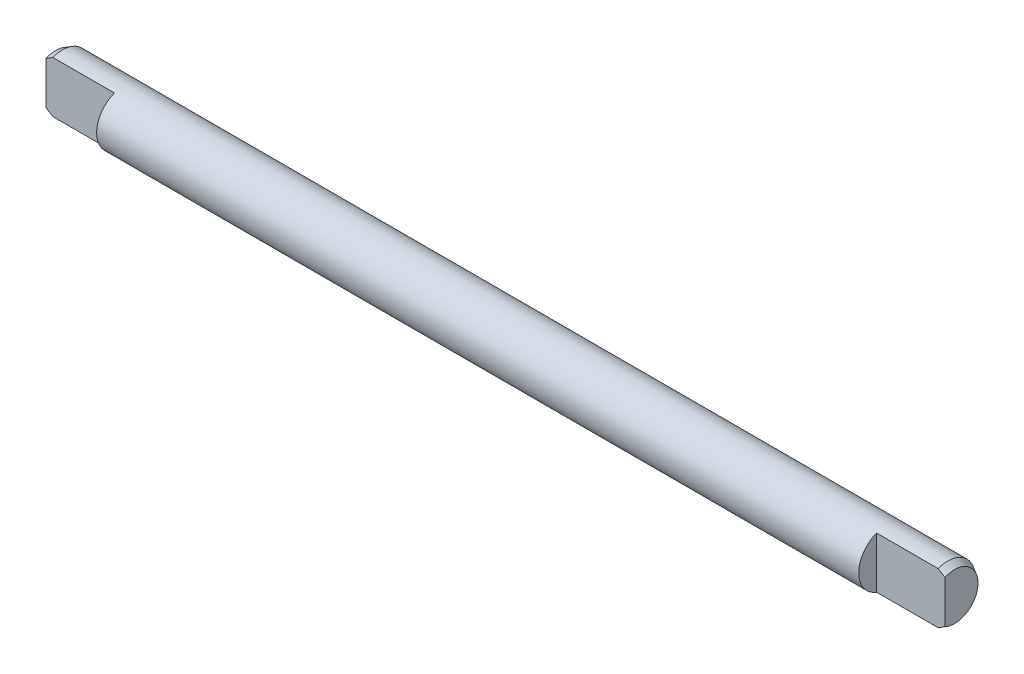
ISO-10303-21;
HEADER;
FILE_DESCRIPTION(('STEP AP214'),'2;1');
FILE_NAME('part.step','',(''),(''),'','','');
FILE_SCHEMA(('AUTOMOTIVE_DESIGN { 1 0 10303 214 1 1 1 1 }'));
ENDSEC;
DATA;
#1=APPLICATION_CONTEXT('core data for automotive mechanical design processes');
#2=APPLICATION_PROTOCOL_DEFINITION('international standard','automotive_design',2000,#1);
#3=PRODUCT_CONTEXT('',#1,'mechanical');
#4=PRODUCT('Part','Part','',(#3));
#5=PRODUCT_RELATED_PRODUCT_CATEGORY('part','',(#4));
#6=PRODUCT_DEFINITION_FORMATION('','',#4);
#7=PRODUCT_DEFINITION_CONTEXT('part definition',#1,'design');
#8=PRODUCT_DEFINITION('design','',#6,#7);
#9=PRODUCT_DEFINITION_SHAPE('','',#8);
#10=(LENGTH_UNIT() NAMED_UNIT(*) SI_UNIT(.MILLI.,.METRE.));
#11=(NAMED_UNIT(*) PLANE_ANGLE_UNIT() SI_UNIT($,.RADIAN.));
#12=(NAMED_UNIT(*) SI_UNIT($,.STERADIAN.) SOLID_ANGLE_UNIT());
#13=UNCERTAINTY_MEASURE_WITH_UNIT(LENGTH_MEASURE(1.E-05),#10,'distance_accuracy_value','');
#14=(GEOMETRIC_REPRESENTATION_CONTEXT(3) GLOBAL_UNCERTAINTY_ASSIGNED_CONTEXT((#13)) GLOBAL_UNIT_ASSIGNED_CONTEXT((#10,
#11,#12)) REPRESENTATION_CONTEXT('',''));
#15=CARTESIAN_POINT('',(0.,0.,0.));
#16=DIRECTION('',(0.,0.,1.));
#17=DIRECTION('',(1.,0.,0.));
#18=AXIS2_PLACEMENT_3D('',#15,#16,#17);
#19=CARTESIAN_POINT('',(10.15,-1.731860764,0.7));
#20=DIRECTION('',(1.,0.,0.));
#21=DIRECTION('',(0.,0.,-1.));
#22=AXIS2_PLACEMENT_3D('',#19,#20,#21);
#23=PLANE('',#22);
#24=DIRECTION('',(0.,-1.,0.));
#25=VECTOR('',#24,1.);
#26=CARTESIAN_POINT('',(10.15,0.,0.7));
#27=LINE('',#26,#25);
#28=CARTESIAN_POINT('',(10.1500000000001,1.56161224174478,0.7));
#29=VERTEX_POINT('',#28);
#30=CARTESIAN_POINT('',(10.1499999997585,-1.56161224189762,0.7));
#31=VERTEX_POINT('',#30);
#32=EDGE_CURVE('E61',#29,#31,#27,.T.);
#33=ORIENTED_EDGE('',*,*,#32,.T.);
#34=CARTESIAN_POINT('',(10.1500000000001,0.,0.));
#35=DIRECTION('',(-1.,0.,0.));
#36=DIRECTION('',(0.,0.,1.));
#37=AXIS2_PLACEMENT_3D('',#34,#35,#36);
#38=CIRCLE('',#37,1.71132486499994);
#39=EDGE_CURVE('E20',#31,#29,#38,.F.);
#40=ORIENTED_EDGE('',*,*,#39,.T.);
#41=EDGE_LOOP('',(#33,#40));
#42=FACE_BOUND('',#41,.T.);
#43=ADVANCED_FACE('F16',(#42),#23,.T.);
#44=CARTESIAN_POINT('',(5.15,-1.895981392,0.7));
#45=DIRECTION('',(-1.,0.,0.));
#46=DIRECTION('',(0.,0.,1.));
#47=AXIS2_PLACEMENT_3D('',#44,#45,#46);
#48=PLANE('',#47);
#49=CARTESIAN_POINT('',(5.1500000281,-1.0443035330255E-13,0.));
#50=DIRECTION('',(1.,0.,0.));
#51=DIRECTION('',(0.,1.,0.));
#52=AXIS2_PLACEMENT_3D('',#49,#50,#51);
#53=CIRCLE('',#52,2.);
#54=CARTESIAN_POINT('',(5.15000001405,1.87349939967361,0.699999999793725));
#55=VERTEX_POINT('',#54);
#56=CARTESIAN_POINT('',(5.15000001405,-1.87349939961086,0.699999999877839));
#57=VERTEX_POINT('',#56);
#58=EDGE_CURVE('E134',#55,#57,#53,.T.);
#59=ORIENTED_EDGE('',*,*,#58,.T.);
#60=DIRECTION('',(0.,1.,0.));
#61=VECTOR('',#60,1.);
#62=CARTESIAN_POINT('',(5.15,0.,0.7));
#63=LINE('',#62,#61);
#64=EDGE_CURVE('E74',#57,#55,#63,.T.);
#65=ORIENTED_EDGE('',*,*,#64,.T.);
#66=EDGE_LOOP('',(#59,#65));
#67=FACE_BOUND('',#66,.T.);
#68=ADVANCED_FACE('F104',(#67),#48,.F.);
#69=CARTESIAN_POINT('',(10.15,-1.8734994,0.7));
#70=DIRECTION('',(0.,0.,-1.));
#71=DIRECTION('',(-1.,0.,0.));
#72=AXIS2_PLACEMENT_3D('',#69,#70,#71);
#73=PLANE('',#72);
#74=CARTESIAN_POINT('',(9.64999999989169,-1.87349939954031,0.699999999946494));
#75=CARTESIAN_POINT('',(9.69180588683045,-1.84773253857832,0.699999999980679));
#76=CARTESIAN_POINT('',(9.73358315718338,-1.82191917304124,0.699999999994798));
#77=CARTESIAN_POINT('',(9.81707123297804,-1.7701859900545,0.700000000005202));
#78=CARTESIAN_POINT('',(9.85878203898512,-1.74426617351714,0.700000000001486));
#79=CARTESIAN_POINT('',(9.94212874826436,-1.69230615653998,0.699999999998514));
#80=CARTESIAN_POINT('',(9.98376465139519,-1.66626595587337,0.699999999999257));
#81=CARTESIAN_POINT('',(10.0669501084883,-1.61404722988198,0.700000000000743));
#82=CARTESIAN_POINT('',(10.1084996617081,-1.58786870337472,0.700000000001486));
#83=CARTESIAN_POINT('',(10.1499999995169,-1.56161224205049,0.7));
#84=B_SPLINE_CURVE_WITH_KNOTS('',3,(#74,#75,#76,#77,#78,#79,#80,#81,#82,#83),.UNSPECIFIED.,.F.,
.F.,(4,2,2,2,4),(0.,0.147326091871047,0.294650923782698,0.44197603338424,0.589302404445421),.UNSPECIFIED.);
#85=CARTESIAN_POINT('',(9.64999999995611,-1.87349939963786,0.699999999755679));
#86=VERTEX_POINT('',#85);
#87=EDGE_CURVE('E73',#86,#31,#84,.T.);
#88=ORIENTED_EDGE('',*,*,#87,.T.);
#89=ORIENTED_EDGE('',*,*,#32,.F.);
#90=CARTESIAN_POINT('',(10.1499999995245,1.56161224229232,0.700000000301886));
#91=CARTESIAN_POINT('',(10.108499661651,1.58786870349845,0.700000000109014));
#92=CARTESIAN_POINT('',(10.066950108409,1.61404722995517,0.70000000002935));
#93=CARTESIAN_POINT('',(9.98376465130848,1.66626595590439,0.699999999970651));
#94=CARTESIAN_POINT('',(9.94212874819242,1.69230615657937,0.699999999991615));
#95=CARTESIAN_POINT('',(9.85878203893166,1.74426617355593,0.700000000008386));
#96=CARTESIAN_POINT('',(9.81707123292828,1.77018599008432,0.700000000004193));
#97=CARTESIAN_POINT('',(9.73358315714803,1.82191917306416,0.699999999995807));
#98=CARTESIAN_POINT('',(9.69180588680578,1.84773253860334,0.699999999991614));
#99=CARTESIAN_POINT('',(9.64999999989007,1.87349939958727,0.7));
#100=B_SPLINE_CURVE_WITH_KNOTS('',3,(#90,#91,#92,#93,#94,#95,#96,#97,#98,#99),.UNSPECIFIED.,.F.,
.F.,(4,2,2,2,4),(0.,0.147326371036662,0.294651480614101,0.441976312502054,0.589302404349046),.UNSPECIFIED.);
#101=CARTESIAN_POINT('',(9.64999999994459,1.87349939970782,0.699999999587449));
#102=VERTEX_POINT('',#101);
#103=EDGE_CURVE('E67',#29,#102,#100,.T.);
#104=ORIENTED_EDGE('',*,*,#103,.T.);
#105=DIRECTION('',(1.,0.,0.));
#106=VECTOR('',#105,1.);
#107=CARTESIAN_POINT('',(-22.7,1.8734993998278,0.699999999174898));
#108=LINE('',#107,#106);
#109=EDGE_CURVE('E79',#102,#55,#108,.F.);
#110=ORIENTED_EDGE('',*,*,#109,.T.);
#111=ORIENTED_EDGE('',*,*,#64,.F.);
#112=DIRECTION('',(-1.,0.,0.));
#113=VECTOR('',#112,1.);
#114=CARTESIAN_POINT('',(-22.7,-1.87349939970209,0.699999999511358));
#115=LINE('',#114,#113);
#116=EDGE_CURVE('E166',#57,#86,#115,.F.);
#117=ORIENTED_EDGE('',*,*,#116,.T.);
#118=EDGE_LOOP('',(#88,#89,#104,#110,#111,#117));
#119=FACE_BOUND('',#118,.T.);
#120=ADVANCED_FACE('F70',(#119),#73,.F.);
#121=CARTESIAN_POINT('',(10.15,0.,0.));
#122=DIRECTION('',(-1.,0.,0.));
#123=DIRECTION('',(0.,0.,1.));
#124=AXIS2_PLACEMENT_3D('',#121,#122,#123);
#125=CONICAL_SURFACE('',#124,1.711324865,0.523598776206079);
#126=CARTESIAN_POINT('',(9.65,0.,0.));
#127=DIRECTION('',(1.,0.,0.));
#128=DIRECTION('',(0.,0.,-1.));
#129=AXIS2_PLACEMENT_3D('',#126,#127,#128);
#130=CIRCLE('',#129,2.);
#131=EDGE_CURVE('E78',#86,#102,#130,.T.);
#132=ORIENTED_EDGE('',*,*,#131,.T.);
#133=ORIENTED_EDGE('',*,*,#103,.F.);
#134=ORIENTED_EDGE('',*,*,#39,.F.);
#135=ORIENTED_EDGE('',*,*,#87,.F.);
#136=EDGE_LOOP('',(#132,#133,#134,#135));
#137=FACE_BOUND('',#136,.T.);
#138=ADVANCED_FACE('F76',(#137),#125,.T.);
#139=CARTESIAN_POINT('',(-50.55,-1.895981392,2.0078));
#140=DIRECTION('',(1.,0.,0.));
#141=DIRECTION('',(0.,0.,-1.));
#142=AXIS2_PLACEMENT_3D('',#139,#140,#141);
#143=PLANE('',#142);
#144=CARTESIAN_POINT('',(-50.5500000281,0.,0.));
#145=DIRECTION('',(1.,0.,0.));
#146=DIRECTION('',(0.,1.,0.));
#147=AXIS2_PLACEMENT_3D('',#144,#145,#146);
#148=CIRCLE('',#147,2.);
#149=CARTESIAN_POINT('',(-50.55000001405,-1.87349939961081,0.699999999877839));
#150=VERTEX_POINT('',#149);
#151=CARTESIAN_POINT('',(-50.55000001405,1.87349939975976,0.7));
#152=VERTEX_POINT('',#151);
#153=EDGE_CURVE('E147',#150,#152,#148,.F.);
#154=ORIENTED_EDGE('',*,*,#153,.T.);
#155=DIRECTION('',(0.,-1.,0.));
#156=VECTOR('',#155,1.);
#157=CARTESIAN_POINT('',(-50.55,0.,0.7));
#158=LINE('',#157,#156);
#159=EDGE_CURVE('E150',#152,#150,#158,.T.);
#160=ORIENTED_EDGE('',*,*,#159,.T.);
#161=EDGE_LOOP('',(#154,#160));
#162=FACE_BOUND('',#161,.T.);
#163=ADVANCED_FACE('F99',(#162),#143,.F.);
#164=CARTESIAN_POINT('',(-50.55,-1.8734994,0.7));
#165=DIRECTION('',(0.,0.,-1.));
#166=DIRECTION('',(-1.,0.,0.));
#167=AXIS2_PLACEMENT_3D('',#164,#165,#166);
#168=PLANE('',#167);
#169=CARTESIAN_POINT('',(-55.0499999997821,1.87349939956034,0.699999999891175));
#170=CARTESIAN_POINT('',(-55.0918058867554,1.84773253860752,0.699999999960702));
#171=CARTESIAN_POINT('',(-55.1335831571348,1.82191917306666,0.69999999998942));
#172=CARTESIAN_POINT('',(-55.2170712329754,1.77018599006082,0.70000000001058));
#173=CARTESIAN_POINT('',(-55.2587820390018,1.74426617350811,0.700000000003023));
#174=CARTESIAN_POINT('',(-55.3421287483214,1.69230615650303,0.699999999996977));
#175=CARTESIAN_POINT('',(-55.3837646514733,1.66626595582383,0.699999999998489));
#176=CARTESIAN_POINT('',(-55.4669501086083,1.61404722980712,0.700000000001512));
#177=CARTESIAN_POINT('',(-55.5084996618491,1.58786870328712,0.700000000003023));
#178=CARTESIAN_POINT('',(-55.5499999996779,1.56161224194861,0.7));
#179=B_SPLINE_CURVE_WITH_KNOTS('',3,(#169,#170,#171,#172,#173,#174,#175,#176,#177,#178),
.UNSPECIFIED.,.F.,.F.,(4,2,2,2,4),(0.,0.147326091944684,0.294650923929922,0.441976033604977,
0.589302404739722),.UNSPECIFIED.);
#180=CARTESIAN_POINT('',(-55.0499999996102,1.87349939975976,0.7));
#181=VERTEX_POINT('',#180);
#182=CARTESIAN_POINT('',(-55.5499999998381,1.56161224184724,0.7));
#183=VERTEX_POINT('',#182);
#184=EDGE_CURVE('E127',#181,#183,#179,.T.);
#185=ORIENTED_EDGE('',*,*,#184,.T.);
#186=DIRECTION('',(0.,-1.,0.));
#187=VECTOR('',#186,1.);
#188=CARTESIAN_POINT('',(-55.55,0.,0.7));
#189=LINE('',#188,#187);
#190=CARTESIAN_POINT('',(-55.5499999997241,-1.56161224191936,0.7));
#191=VERTEX_POINT('',#190);
#192=EDGE_CURVE('E152',#183,#191,#189,.T.);
#193=ORIENTED_EDGE('',*,*,#192,.T.);
#194=CARTESIAN_POINT('',(-55.0499999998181,-1.87349939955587,0.699999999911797));
#195=CARTESIAN_POINT('',(-55.0918058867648,-1.84773253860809,0.699999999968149));
#196=CARTESIAN_POINT('',(-55.1335831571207,-1.82191917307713,0.699999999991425));
#197=CARTESIAN_POINT('',(-55.2170712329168,-1.77018599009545,0.700000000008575));
#198=CARTESIAN_POINT('',(-55.2587820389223,-1.74426617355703,0.70000000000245));
#199=CARTESIAN_POINT('',(-55.3421287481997,-1.69230615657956,0.69999999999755));
#200=CARTESIAN_POINT('',(-55.3837646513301,-1.66626595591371,0.699999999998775));
#201=CARTESIAN_POINT('',(-55.4669501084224,-1.61404722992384,0.700000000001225));
#202=CARTESIAN_POINT('',(-55.5084996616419,-1.58786870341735,0.70000000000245));
#203=CARTESIAN_POINT('',(-55.5499999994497,-1.56161224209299,0.7));
#204=B_SPLINE_CURVE_WITH_KNOTS('',3,(#194,#195,#196,#197,#198,#199,#200,#201,#202,#203),
.UNSPECIFIED.,.F.,.F.,(4,2,2,2,4),(0.,0.147326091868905,0.294650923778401,0.441976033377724,
0.589302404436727),.UNSPECIFIED.);
#205=CARTESIAN_POINT('',(-55.049999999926,-1.87349939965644,0.699999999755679));
#206=VERTEX_POINT('',#205);
#207=EDGE_CURVE('E35',#206,#191,#204,.T.);
#208=ORIENTED_EDGE('',*,*,#207,.F.);
#209=DIRECTION('',(-1.,0.,0.));
#210=VECTOR('',#209,1.);
#211=CARTESIAN_POINT('',(-22.7,-1.87349939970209,0.699999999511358));
#212=LINE('',#211,#210);
#213=EDGE_CURVE('E153',#206,#150,#212,.F.);
#214=ORIENTED_EDGE('',*,*,#213,.T.);
#215=ORIENTED_EDGE('',*,*,#159,.F.);
#216=DIRECTION('',(1.,0.,0.));
#217=VECTOR('',#216,1.);
#218=CARTESIAN_POINT('',(-53.05,1.8734994,0.7));
#219=LINE('',#218,#217);
#220=EDGE_CURVE('E135',#181,#152,#219,.T.);
#221=ORIENTED_EDGE('',*,*,#220,.F.);
#222=EDGE_LOOP('',(#185,#193,#208,#214,#215,#221));
#223=FACE_BOUND('',#222,.T.);
#224=ADVANCED_FACE('F137',(#223),#168,.F.);
#225=CARTESIAN_POINT('',(-55.05,0.,0.));
#226=DIRECTION('',(1.,0.,0.));
#227=DIRECTION('',(0.,1.,0.));
#228=AXIS2_PLACEMENT_3D('',#225,#226,#227);
#229=CYLINDRICAL_SURFACE('',#228,2.);
#230=CARTESIAN_POINT('',(-55.05,0.,0.));
#231=DIRECTION('',(1.,0.,0.));
#232=DIRECTION('',(0.,0.,-1.));
#233=AXIS2_PLACEMENT_3D('',#230,#231,#232);
#234=CIRCLE('',#233,2.);
#235=EDGE_CURVE('E26',#206,#181,#234,.T.);
#236=ORIENTED_EDGE('',*,*,#235,.T.);
#237=ORIENTED_EDGE('',*,*,#220,.T.);
#238=ORIENTED_EDGE('',*,*,#153,.F.);
#239=ORIENTED_EDGE('',*,*,#213,.F.);
#240=EDGE_LOOP('',(#236,#237,#238,#239));
#241=FACE_BOUND('',#240,.T.);
#242=ORIENTED_EDGE('',*,*,#109,.F.);
#243=ORIENTED_EDGE('',*,*,#131,.F.);
#244=ORIENTED_EDGE('',*,*,#116,.F.);
#245=ORIENTED_EDGE('',*,*,#58,.F.);
#246=EDGE_LOOP('',(#242,#243,#244,#245));
#247=FACE_BOUND('',#246,.T.);
#248=ADVANCED_FACE('F100',(#241,#247),#229,.T.);
#249=CARTESIAN_POINT('',(-55.55,-1.731860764,0.7));
#250=DIRECTION('',(1.,0.,0.));
#251=DIRECTION('',(0.,0.,-1.));
#252=AXIS2_PLACEMENT_3D('',#249,#250,#251);
#253=PLANE('',#252);
#254=CARTESIAN_POINT('',(-55.55,0.,0.));
#255=DIRECTION('',(1.,0.,0.));
#256=DIRECTION('',(0.,1.,0.));
#257=AXIS2_PLACEMENT_3D('',#254,#255,#256);
#258=CIRCLE('',#257,1.711324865);
#259=EDGE_CURVE('E11',#183,#191,#258,.F.);
#260=ORIENTED_EDGE('',*,*,#259,.T.);
#261=ORIENTED_EDGE('',*,*,#192,.F.);
#262=EDGE_LOOP('',(#260,#261));
#263=FACE_BOUND('',#262,.T.);
#264=ADVANCED_FACE('F18',(#263),#253,.F.);
#265=CARTESIAN_POINT('',(-55.55,0.,0.));
#266=DIRECTION('',(1.,0.,0.));
#267=DIRECTION('',(0.,1.,0.));
#268=AXIS2_PLACEMENT_3D('',#265,#266,#267);
#269=CONICAL_SURFACE('',#268,1.711324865,0.523598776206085);
#270=ORIENTED_EDGE('',*,*,#259,.F.);
#271=ORIENTED_EDGE('',*,*,#184,.F.);
#272=ORIENTED_EDGE('',*,*,#235,.F.);
#273=ORIENTED_EDGE('',*,*,#207,.T.);
#274=EDGE_LOOP('',(#270,#271,#272,#273));
#275=FACE_BOUND('',#274,.T.);
#276=ADVANCED_FACE('F112',(#275),#269,.T.);
#277=CLOSED_SHELL('',(#43,#68,#120,#138,#163,#224,#248,#264,#276));
#278=MANIFOLD_SOLID_BREP('B1',#277);
#279=ADVANCED_BREP_SHAPE_REPRESENTATION('',(#18,#278),#14);
#280=SHAPE_DEFINITION_REPRESENTATION(#9,#279);
ENDSEC;
END-ISO-10303-21;
